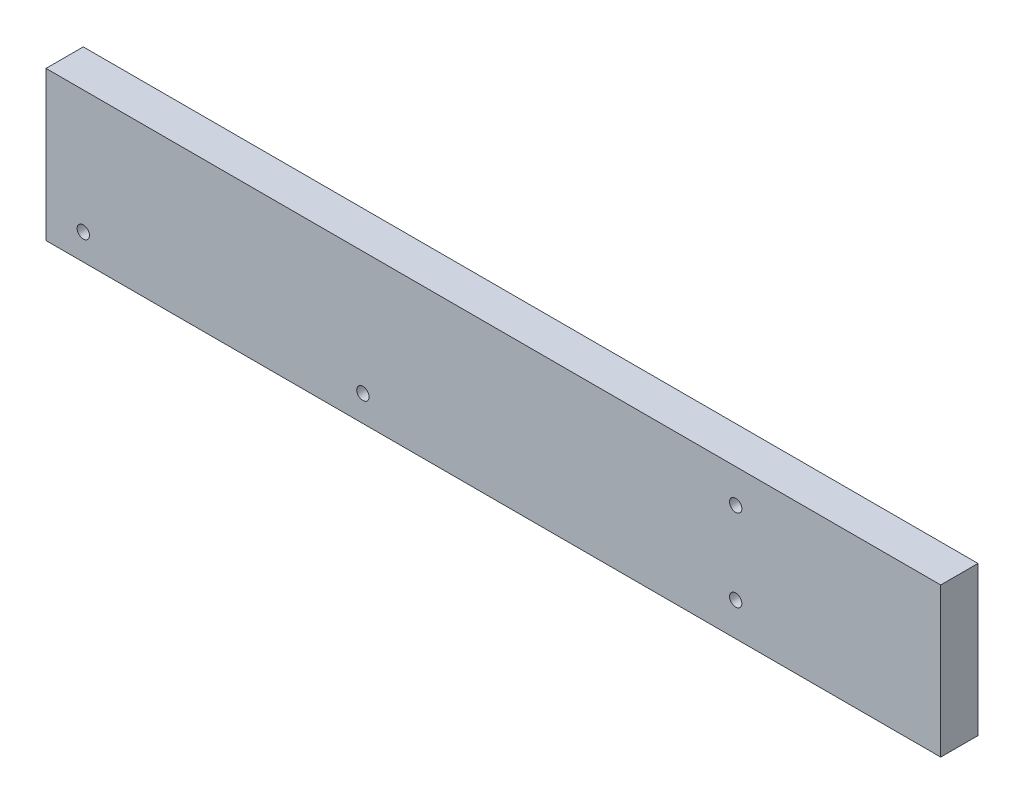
from build123d import *

# Parameters (mm, degrees)
ESQUISSE1_W           = 240
ESQUISSE1_H           = 40
EXTRUSION1_DEPTH      = 5
TROU_TARAUD_M4X0_71_D = 3.3


with BuildPart() as part:
    # Esquisse1 → Extrusion1 (new, symmetric)
    with BuildSketch(Plane.XY):
        with Locations((72.5, 0)):
            Rectangle(ESQUISSE1_W, ESQUISSE1_H)
    extrude(amount=EXTRUSION1_DEPTH, both=True)

    # Trou taraud_ M4x0.71 (through all)
    with Locations(Plane.XY.offset(5)):
        with Locations((-37.5, -13), (37.5, -13), (137.5, -11), (137.5, 11)):
            Hole(TROU_TARAUD_M4X0_71_D / 2)


solid = part.part
